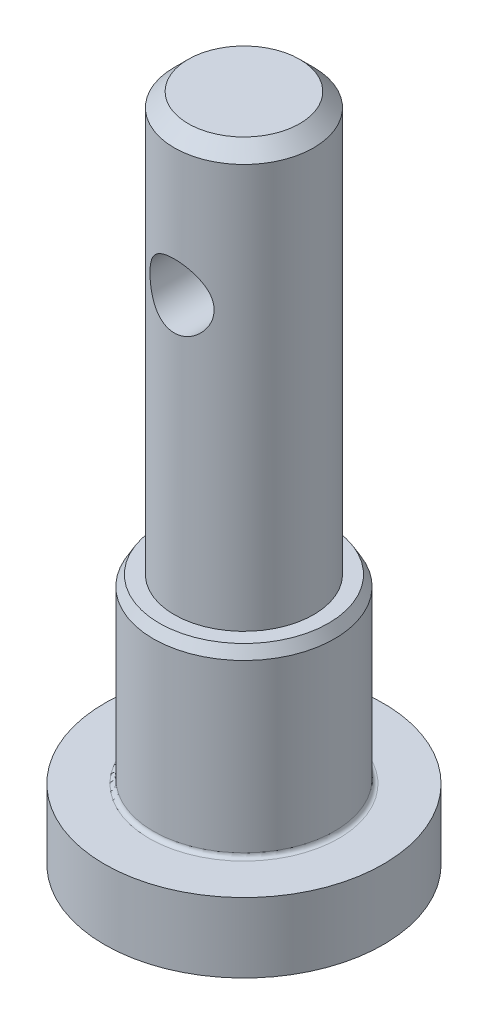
ISO-10303-21;
HEADER;
FILE_DESCRIPTION(('STEP AP214'),'2;1');
FILE_NAME('part.step','',(''),(''),'','','');
FILE_SCHEMA(('AUTOMOTIVE_DESIGN { 1 0 10303 214 1 1 1 1 }'));
ENDSEC;
DATA;
#1=APPLICATION_CONTEXT('core data for automotive mechanical design processes');
#2=APPLICATION_PROTOCOL_DEFINITION('international standard','automotive_design',2000,#1);
#3=PRODUCT_CONTEXT('',#1,'mechanical');
#4=PRODUCT('Part','Part','',(#3));
#5=PRODUCT_RELATED_PRODUCT_CATEGORY('part','',(#4));
#6=PRODUCT_DEFINITION_FORMATION('','',#4);
#7=PRODUCT_DEFINITION_CONTEXT('part definition',#1,'design');
#8=PRODUCT_DEFINITION('design','',#6,#7);
#9=PRODUCT_DEFINITION_SHAPE('','',#8);
#10=(LENGTH_UNIT() NAMED_UNIT(*) SI_UNIT(.MILLI.,.METRE.));
#11=(NAMED_UNIT(*) PLANE_ANGLE_UNIT() SI_UNIT($,.RADIAN.));
#12=(NAMED_UNIT(*) SI_UNIT($,.STERADIAN.) SOLID_ANGLE_UNIT());
#13=UNCERTAINTY_MEASURE_WITH_UNIT(LENGTH_MEASURE(1.E-05),#10,'distance_accuracy_value','');
#14=(GEOMETRIC_REPRESENTATION_CONTEXT(3) GLOBAL_UNCERTAINTY_ASSIGNED_CONTEXT((#13)) GLOBAL_UNIT_ASSIGNED_CONTEXT((#10,
#11,#12)) REPRESENTATION_CONTEXT('',''));
#15=CARTESIAN_POINT('',(0.,0.,0.));
#16=DIRECTION('',(0.,0.,1.));
#17=DIRECTION('',(1.,0.,0.));
#18=AXIS2_PLACEMENT_3D('',#15,#16,#17);
#19=CARTESIAN_POINT('',(0.,49.5125,0.));
#20=DIRECTION('',(0.,1.,0.));
#21=DIRECTION('',(0.,0.,1.));
#22=AXIS2_PLACEMENT_3D('',#19,#20,#21);
#23=CYLINDRICAL_SURFACE('',#22,6.49999999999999);
#24=CARTESIAN_POINT('',(0.,0.300000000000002,0.));
#25=DIRECTION('',(0.,1.,0.));
#26=DIRECTION('',(0.,0.,1.));
#27=AXIS2_PLACEMENT_3D('',#24,#25,#26);
#28=CIRCLE('',#27,6.49999999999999);
#29=CARTESIAN_POINT('',(0.,0.300000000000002,6.49999999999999));
#30=VERTEX_POINT('',#29);
#31=EDGE_CURVE('E32',#30,#30,#28,.T.);
#32=ORIENTED_EDGE('',*,*,#31,.T.);
#33=EDGE_LOOP('',(#32));
#34=FACE_BOUND('',#33,.T.);
#35=CARTESIAN_POINT('',(0.,12.25,0.));
#36=DIRECTION('',(0.,1.,0.));
#37=DIRECTION('',(0.,0.,1.));
#38=AXIS2_PLACEMENT_3D('',#35,#36,#37);
#39=CIRCLE('',#38,6.49999999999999);
#40=CARTESIAN_POINT('',(0.,12.25,6.49999999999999));
#41=VERTEX_POINT('',#40);
#42=EDGE_CURVE('E45',#41,#41,#39,.F.);
#43=ORIENTED_EDGE('',*,*,#42,.T.);
#44=EDGE_LOOP('',(#43));
#45=FACE_BOUND('',#44,.T.);
#46=ADVANCED_FACE('F26',(#34,#45),#23,.T.);
#47=CARTESIAN_POINT('',(6.49999999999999,0.,0.));
#48=DIRECTION('',(0.,1.,0.));
#49=DIRECTION('',(0.,0.,1.));
#50=AXIS2_PLACEMENT_3D('',#47,#48,#49);
#51=PLANE('',#50);
#52=CARTESIAN_POINT('',(0.,0.,0.));
#53=DIRECTION('',(0.,1.,0.));
#54=DIRECTION('',(0.,0.,1.));
#55=AXIS2_PLACEMENT_3D('',#52,#53,#54);
#56=CIRCLE('',#55,6.79999999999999);
#57=CARTESIAN_POINT('',(0.,0.,6.79999999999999));
#58=VERTEX_POINT('',#57);
#59=EDGE_CURVE('E10',#58,#58,#56,.F.);
#60=ORIENTED_EDGE('',*,*,#59,.T.);
#61=EDGE_LOOP('',(#60));
#62=FACE_BOUND('',#61,.T.);
#63=CARTESIAN_POINT('',(0.,0.,0.));
#64=DIRECTION('',(0.,1.,0.));
#65=DIRECTION('',(0.,0.,1.));
#66=AXIS2_PLACEMENT_3D('',#63,#64,#65);
#67=CIRCLE('',#66,9.99999999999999);
#68=CARTESIAN_POINT('',(0.,0.,9.99999999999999));
#69=VERTEX_POINT('',#68);
#70=EDGE_CURVE('E51',#69,#69,#67,.T.);
#71=ORIENTED_EDGE('',*,*,#70,.T.);
#72=EDGE_LOOP('',(#71));
#73=FACE_BOUND('',#72,.T.);
#74=ADVANCED_FACE('F86',(#62,#73),#51,.T.);
#75=CARTESIAN_POINT('',(0.,49.5125,0.));
#76=DIRECTION('',(0.,1.,0.));
#77=DIRECTION('',(0.,0.,1.));
#78=AXIS2_PLACEMENT_3D('',#75,#76,#77);
#79=CYLINDRICAL_SURFACE('',#78,9.99999999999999);
#80=CARTESIAN_POINT('',(0.,-5.,0.));
#81=DIRECTION('',(0.,1.,0.));
#82=DIRECTION('',(0.,0.,1.));
#83=AXIS2_PLACEMENT_3D('',#80,#81,#82);
#84=CIRCLE('',#83,9.99999999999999);
#85=CARTESIAN_POINT('',(0.,-5.,9.99999999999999));
#86=VERTEX_POINT('',#85);
#87=EDGE_CURVE('E127',#86,#86,#84,.T.);
#88=ORIENTED_EDGE('',*,*,#87,.T.);
#89=EDGE_LOOP('',(#88));
#90=FACE_BOUND('',#89,.T.);
#91=ORIENTED_EDGE('',*,*,#70,.F.);
#92=EDGE_LOOP('',(#91));
#93=FACE_BOUND('',#92,.T.);
#94=ADVANCED_FACE('F90',(#90,#93),#79,.T.);
#95=CARTESIAN_POINT('',(9.99999999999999,-5.,0.));
#96=DIRECTION('',(0.,-1.,0.));
#97=DIRECTION('',(0.,0.,-1.));
#98=AXIS2_PLACEMENT_3D('',#95,#96,#97);
#99=PLANE('',#98);
#100=ORIENTED_EDGE('',*,*,#87,.F.);
#101=EDGE_LOOP('',(#100));
#102=FACE_BOUND('',#101,.T.);
#103=ADVANCED_FACE('F113',(#102),#99,.T.);
#104=CARTESIAN_POINT('',(5.,43.,0.));
#105=DIRECTION('',(0.,-1.,0.));
#106=DIRECTION('',(0.,0.,-1.));
#107=AXIS2_PLACEMENT_3D('',#104,#105,#106);
#108=PLANE('',#107);
#109=CARTESIAN_POINT('',(0.,43.,0.));
#110=DIRECTION('',(0.,-1.,0.));
#111=DIRECTION('',(0.,0.,-1.));
#112=AXIS2_PLACEMENT_3D('',#109,#110,#111);
#113=CIRCLE('',#112,3.99999999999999);
#114=CARTESIAN_POINT('',(0.,43.,-3.99999999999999));
#115=VERTEX_POINT('',#114);
#116=EDGE_CURVE('E40',#115,#115,#113,.F.);
#117=ORIENTED_EDGE('',*,*,#116,.T.);
#118=EDGE_LOOP('',(#117));
#119=FACE_BOUND('',#118,.T.);
#120=ADVANCED_FACE('F82',(#119),#108,.F.);
#121=CARTESIAN_POINT('',(0.,49.5125,0.));
#122=DIRECTION('',(0.,1.,0.));
#123=DIRECTION('',(0.,0.,1.));
#124=AXIS2_PLACEMENT_3D('',#121,#122,#123);
#125=CYLINDRICAL_SURFACE('',#124,5.);
#126=CARTESIAN_POINT('',(0.,42.,0.));
#127=DIRECTION('',(0.,-1.,0.));
#128=DIRECTION('',(0.,0.,-1.));
#129=AXIS2_PLACEMENT_3D('',#126,#127,#128);
#130=CIRCLE('',#129,5.);
#131=CARTESIAN_POINT('',(0.,42.,-5.));
#132=VERTEX_POINT('',#131);
#133=EDGE_CURVE('E36',#132,#132,#130,.T.);
#134=ORIENTED_EDGE('',*,*,#133,.T.);
#135=EDGE_LOOP('',(#134));
#136=FACE_BOUND('',#135,.T.);
#137=CARTESIAN_POINT('',(0.,30.5,5.));
#138=CARTESIAN_POINT('',(-0.122041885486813,30.500007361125,4.99999394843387));
#139=CARTESIAN_POINT('',(-0.244266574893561,30.509771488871,4.9954819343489));
#140=CARTESIAN_POINT('',(-0.485172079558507,30.5484315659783,4.97787855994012));
#141=CARTESIAN_POINT('',(-0.60384419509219,30.5773710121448,4.96476769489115));
#142=CARTESIAN_POINT('',(-0.833783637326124,30.6530493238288,4.93135409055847));
#143=CARTESIAN_POINT('',(-0.945076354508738,30.6997229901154,4.91107771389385));
#144=CARTESIAN_POINT('',(-1.15811916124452,30.8092418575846,4.86524923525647));
#145=CARTESIAN_POINT('',(-1.25987101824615,30.872084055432,4.8396981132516));
#146=CARTESIAN_POINT('',(-1.45708046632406,31.016014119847,4.78413705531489));
#147=CARTESIAN_POINT('',(-1.55190939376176,31.0978987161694,4.75396163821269));
#148=CARTESIAN_POINT('',(-1.72705007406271,31.2758922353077,4.69317680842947));
#149=CARTESIAN_POINT('',(-1.80735254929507,31.3720101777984,4.66256713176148));
#150=CARTESIAN_POINT('',(-1.95619272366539,31.5830346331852,4.60219146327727));
#151=CARTESIAN_POINT('',(-2.02367242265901,31.6987427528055,4.57259970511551));
#152=CARTESIAN_POINT('',(-2.13793458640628,31.9414033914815,4.52031110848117));
#153=CARTESIAN_POINT('',(-2.18472992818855,32.0683488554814,4.49760998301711));
#154=CARTESIAN_POINT('',(-2.25356357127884,32.3226817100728,4.46350341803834));
#155=CARTESIAN_POINT('',(-2.27682015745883,32.4496621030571,4.45154619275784));
#156=CARTESIAN_POINT('',(-2.30169250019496,32.7062411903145,4.43874186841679));
#157=CARTESIAN_POINT('',(-2.30332435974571,32.8358378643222,4.43788650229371));
#158=CARTESIAN_POINT('',(-2.28580488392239,33.0804608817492,4.44692638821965));
#159=CARTESIAN_POINT('',(-2.26866065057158,33.1956778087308,4.4557835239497));
#160=CARTESIAN_POINT('',(-2.21749774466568,33.4213683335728,4.48146341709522));
#161=CARTESIAN_POINT('',(-2.18347490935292,33.531840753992,4.49828813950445));
#162=CARTESIAN_POINT('',(-2.09885026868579,33.7479504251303,4.53839772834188));
#163=CARTESIAN_POINT('',(-2.04788648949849,33.8534189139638,4.56182176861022));
#164=CARTESIAN_POINT('',(-1.93109049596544,34.0547713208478,4.61247614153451));
#165=CARTESIAN_POINT('',(-1.86525184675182,34.1506510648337,4.63970811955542));
#166=CARTESIAN_POINT('',(-1.71247557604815,34.3407178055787,4.69838219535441));
#167=CARTESIAN_POINT('',(-1.6240473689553,34.4336667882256,4.7299659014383));
#168=CARTESIAN_POINT('',(-1.43262626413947,34.6038826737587,4.79141773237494));
#169=CARTESIAN_POINT('',(-1.32962834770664,34.6811441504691,4.82128526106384));
#170=CARTESIAN_POINT('',(-1.10752206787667,34.8201781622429,4.87718425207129));
#171=CARTESIAN_POINT('',(-0.987987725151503,34.8813409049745,4.90305249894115));
#172=CARTESIAN_POINT('',(-0.738830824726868,34.9822371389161,4.94672403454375));
#173=CARTESIAN_POINT('',(-0.609215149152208,35.0219851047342,4.96453276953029));
#174=CARTESIAN_POINT('',(-0.353823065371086,35.0760874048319,4.98899184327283));
#175=CARTESIAN_POINT('',(-0.228466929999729,35.0920963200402,4.99636737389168));
#176=CARTESIAN_POINT('',(0.0233512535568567,35.1033283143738,5.00152878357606));
#177=CARTESIAN_POINT('',(0.149812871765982,35.0985591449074,4.99931823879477));
#178=CARTESIAN_POINT('',(0.391793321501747,35.0694517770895,4.98600706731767));
#179=CARTESIAN_POINT('',(0.507498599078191,35.0463694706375,4.97547715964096));
#180=CARTESIAN_POINT('',(0.733214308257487,34.9831487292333,4.94725590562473));
#181=CARTESIAN_POINT('',(0.843224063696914,34.9430082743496,4.92956371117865));
#182=CARTESIAN_POINT('',(1.05830091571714,34.8455733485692,4.88798254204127));
#183=CARTESIAN_POINT('',(1.16311052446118,34.7877874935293,4.86391910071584));
#184=CARTESIAN_POINT('',(1.36191969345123,34.6572381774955,4.81204195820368));
#185=CARTESIAN_POINT('',(1.4559144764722,34.5844681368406,4.78422661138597));
#186=CARTESIAN_POINT('',(1.63892933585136,34.4187721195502,4.72482193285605));
#187=CARTESIAN_POINT('',(1.72683348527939,34.3246535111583,4.6931134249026));
#188=CARTESIAN_POINT('',(1.88601098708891,34.1226882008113,4.63144312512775));
#189=CARTESIAN_POINT('',(1.95727704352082,34.0148355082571,4.60148210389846));
#190=CARTESIAN_POINT('',(2.08302279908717,33.784253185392,4.54597558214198));
#191=CARTESIAN_POINT('',(2.13694319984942,33.6611777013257,4.52058702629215));
#192=CARTESIAN_POINT('',(2.22275575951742,33.4061413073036,4.47902545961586));
#193=CARTESIAN_POINT('',(2.25467144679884,33.2741900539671,4.46284260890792));
#194=CARTESIAN_POINT('',(2.29300876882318,33.0177261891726,4.44325691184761));
#195=CARTESIAN_POINT('',(2.30143920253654,32.8935907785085,4.43884851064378));
#196=CARTESIAN_POINT('',(2.29815984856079,32.6456755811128,4.44054834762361));
#197=CARTESIAN_POINT('',(2.28645526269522,32.5218957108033,4.44665386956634));
#198=CARTESIAN_POINT('',(2.24503325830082,32.2871043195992,4.4676951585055));
#199=CARTESIAN_POINT('',(2.21661248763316,32.1758006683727,4.48199353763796));
#200=CARTESIAN_POINT('',(2.14399474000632,31.9595817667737,4.51717890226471));
#201=CARTESIAN_POINT('',(2.099793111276,31.8546684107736,4.5380678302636));
#202=CARTESIAN_POINT('',(1.99356103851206,31.6466397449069,4.5857725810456));
#203=CARTESIAN_POINT('',(1.93055001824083,31.5440954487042,4.61288763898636));
#204=CARTESIAN_POINT('',(1.78970957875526,31.350415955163,4.66933561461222));
#205=CARTESIAN_POINT('',(1.71187344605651,31.2592859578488,4.69866953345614));
#206=CARTESIAN_POINT('',(1.53473287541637,31.0819293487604,4.75963991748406));
#207=CARTESIAN_POINT('',(1.43408232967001,30.9970219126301,4.79122580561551));
#208=CARTESIAN_POINT('',(1.21893934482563,30.8451228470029,4.85042737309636));
#209=CARTESIAN_POINT('',(1.10444046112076,30.778139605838,4.87804119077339));
#210=CARTESIAN_POINT('',(0.865135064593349,30.6648453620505,4.9260790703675));
#211=CARTESIAN_POINT('',(0.740410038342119,30.6183867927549,4.94655422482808));
#212=CARTESIAN_POINT('',(0.548210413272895,30.5652971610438,4.9702780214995));
#213=CARTESIAN_POINT('',(0.48334502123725,30.5503722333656,4.97701856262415));
#214=CARTESIAN_POINT('',(0.352373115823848,30.526180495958,4.98799900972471));
#215=CARTESIAN_POINT('',(0.286267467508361,30.5169098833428,4.99224059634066));
#216=CARTESIAN_POINT('',(0.183335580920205,30.5070248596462,4.99677160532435));
#217=CARTESIAN_POINT('',(0.146730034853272,30.5043923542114,4.99798062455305));
#218=CARTESIAN_POINT('',(0.0734218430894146,30.5008788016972,4.9995957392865));
#219=CARTESIAN_POINT('',(0.0367191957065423,30.4999977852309,5.00000182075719));
#220=CARTESIAN_POINT('',(0.,30.5,5.));
#221=B_SPLINE_CURVE_WITH_KNOTS('',3,(#137,#138,#139,#140,#141,#142,#143,#144,#145,#146,#147,
#148,#149,#150,#151,#152,#153,#154,#155,#156,#157,#158,#159,#160,#161,#162,#163,#164,#165,#166,
#167,#168,#169,#170,#171,#172,#173,#174,#175,#176,#177,#178,#179,#180,#181,#182,#183,#184,#185,
#186,#187,#188,#189,#190,#191,#192,#193,#194,#195,#196,#197,#198,#199,#200,#201,#202,#203,#204,
#205,#206,#207,#208,#209,#210,#211,#212,#213,#214,#215,#216,#217,#218,#219,#220),.UNSPECIFIED.,
.T.,.F.,(4,2,2,2,2,2,2,2,2,2,2,2,2,2,2,2,2,2,2,2,2,2,2,2,2,2,2,2,2,2,2,2,2,2,2,2,2,2,2,2,2,4),
(0.,0.365982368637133,0.732797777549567,1.09827745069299,1.46368928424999,1.84866513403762,
2.23388599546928,2.64334229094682,3.05254331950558,3.43927577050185,3.82572022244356,
4.17455708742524,4.52348002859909,4.88039695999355,5.23746859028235,5.63208508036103,
6.02683783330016,6.43489508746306,6.84267618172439,7.22042533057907,7.59803356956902,
7.95177546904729,8.30555926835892,8.67026658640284,9.03513439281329,9.4312584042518,
9.82755579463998,10.2355832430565,10.6431737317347,11.0146401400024,11.3860105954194,
11.731793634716,12.0776786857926,12.4462889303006,12.8150664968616,13.2193880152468,
13.6238984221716,14.0254512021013,14.2259116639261,14.426237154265,14.5363497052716,
14.6464641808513),.UNSPECIFIED.);
#222=CARTESIAN_POINT('',(0.,30.5,5.));
#223=VERTEX_POINT('',#222);
#224=EDGE_CURVE('E52',#223,#223,#221,.T.);
#225=ORIENTED_EDGE('',*,*,#224,.T.);
#226=EDGE_LOOP('',(#225));
#227=FACE_BOUND('',#226,.T.);
#228=CARTESIAN_POINT('',(2.3,32.8,-4.43959457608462));
#229=CARTESIAN_POINT('',(2.29999229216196,32.9212694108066,-4.43960320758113));
#230=CARTESIAN_POINT('',(2.29034635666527,33.0427278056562,-4.44463694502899));
#231=CARTESIAN_POINT('',(2.25220031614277,33.2820273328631,-4.46408179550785));
#232=CARTESIAN_POINT('',(2.22365453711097,33.3998589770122,-4.47851562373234));
#233=CARTESIAN_POINT('',(2.14912420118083,33.6280088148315,-4.51474887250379));
#234=CARTESIAN_POINT('',(2.10322135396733,33.7383593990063,-4.53651373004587));
#235=CARTESIAN_POINT('',(1.99552627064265,33.9497660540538,-4.58490435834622));
#236=CARTESIAN_POINT('',(1.93373541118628,34.0508229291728,-4.61152970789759));
#237=CARTESIAN_POINT('',(1.79098738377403,34.2485300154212,-4.66890482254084));
#238=CARTESIAN_POINT('',(1.70899924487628,34.3443903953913,-4.69981252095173));
#239=CARTESIAN_POINT('',(1.53033862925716,34.5215995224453,-4.76098502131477));
#240=CARTESIAN_POINT('',(1.43365975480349,34.602941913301,-4.7912495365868));
#241=CARTESIAN_POINT('',(1.2218570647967,34.7531567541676,-4.84971840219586));
#242=CARTESIAN_POINT('',(1.10601183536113,34.8210989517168,-4.87771830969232));
#243=CARTESIAN_POINT('',(0.863009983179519,34.9361781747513,-4.92651307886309));
#244=CARTESIAN_POINT('',(0.735859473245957,34.9833263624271,-4.94731180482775));
#245=CARTESIAN_POINT('',(0.482188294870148,35.0524858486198,-4.97823230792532));
#246=CARTESIAN_POINT('',(0.356114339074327,35.0758705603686,-4.98893449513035));
#247=CARTESIAN_POINT('',(0.101410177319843,35.1013197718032,-5.00059358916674));
#248=CARTESIAN_POINT('',(-0.0272187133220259,35.1033949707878,-5.00155538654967));
#249=CARTESIAN_POINT('',(-0.273228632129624,35.0867921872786,-4.99393438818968));
#250=CARTESIAN_POINT('',(-0.390738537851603,35.069636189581,-4.98605152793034));
#251=CARTESIAN_POINT('',(-0.620992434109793,35.0177238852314,-4.96263685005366));
#252=CARTESIAN_POINT('',(-0.733736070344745,34.9829662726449,-4.9471044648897));
#253=CARTESIAN_POINT('',(-0.953336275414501,34.8964951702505,-4.90955775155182));
#254=CARTESIAN_POINT('',(-1.06007875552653,34.8445344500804,-4.88744941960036));
#255=CARTESIAN_POINT('',(-1.26360680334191,34.7254133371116,-4.83882866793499));
#256=CARTESIAN_POINT('',(-1.36038870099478,34.6582473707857,-4.81231463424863));
#257=CARTESIAN_POINT('',(-1.54981490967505,34.5041689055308,-4.75485722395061));
#258=CARTESIAN_POINT('',(-1.64144667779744,34.4160791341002,-4.72372886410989));
#259=CARTESIAN_POINT('',(-1.80913244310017,34.2258780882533,-4.66208509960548));
#260=CARTESIAN_POINT('',(-1.88517759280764,34.1237589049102,-4.63157005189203));
#261=CARTESIAN_POINT('',(-2.02298376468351,33.9024129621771,-4.57311830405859));
#262=CARTESIAN_POINT('',(-2.0839010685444,33.7826061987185,-4.54537130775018));
#263=CARTESIAN_POINT('',(-2.18426733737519,33.532835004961,-4.4980096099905));
#264=CARTESIAN_POINT('',(-2.22373544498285,33.402879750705,-4.47838766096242));
#265=CARTESIAN_POINT('',(-2.2772070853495,33.1466552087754,-4.45142308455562));
#266=CARTESIAN_POINT('',(-2.29287121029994,33.0208187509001,-4.44328289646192));
#267=CARTESIAN_POINT('',(-2.3032486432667,32.7680788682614,-4.43791534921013));
#268=CARTESIAN_POINT('',(-2.29797231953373,32.6411760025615,-4.44068258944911));
#269=CARTESIAN_POINT('',(-2.26814047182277,32.4013961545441,-4.45598092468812));
#270=CARTESIAN_POINT('',(-2.24527044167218,32.2882471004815,-4.46765771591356));
#271=CARTESIAN_POINT('',(-2.18326656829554,32.0675423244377,-4.49828116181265));
#272=CARTESIAN_POINT('',(-2.14412831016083,31.9599881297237,-4.51722978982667));
#273=CARTESIAN_POINT('',(-2.04875813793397,31.7479942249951,-4.5613002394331));
#274=CARTESIAN_POINT('',(-1.99182701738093,31.6439212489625,-4.58666452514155));
#275=CARTESIAN_POINT('',(-1.86313512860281,31.4462447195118,-4.64042964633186));
#276=CARTESIAN_POINT('',(-1.79136712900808,31.3526463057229,-4.6688319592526));
#277=CARTESIAN_POINT('',(-1.62634842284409,31.1684957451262,-4.72900246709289));
#278=CARTESIAN_POINT('',(-1.53164523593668,31.0792541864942,-4.76081560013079));
#279=CARTESIAN_POINT('',(-1.32796666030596,30.9176055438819,-4.82159640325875));
#280=CARTESIAN_POINT('',(-1.21898859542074,30.8452016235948,-4.85056353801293));
#281=CARTESIAN_POINT('',(-0.987718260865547,30.7186557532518,-4.90292027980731));
#282=CARTESIAN_POINT('',(-0.86527448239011,30.6647573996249,-4.92623438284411));
#283=CARTESIAN_POINT('',(-0.611686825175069,30.578800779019,-4.96409348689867));
#284=CARTESIAN_POINT('',(-0.480549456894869,30.5467263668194,-4.97864496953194));
#285=CARTESIAN_POINT('',(-0.224871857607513,30.507671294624,-4.99644887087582));
#286=CARTESIAN_POINT('',(-0.1006684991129,30.4988538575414,-5.00052761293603));
#287=CARTESIAN_POINT('',(0.147472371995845,30.5013842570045,-4.99936285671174));
#288=CARTESIAN_POINT('',(0.27140994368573,30.5127270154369,-4.99412170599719));
#289=CARTESIAN_POINT('',(0.509049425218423,30.5539607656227,-4.97537766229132));
#290=CARTESIAN_POINT('',(0.622953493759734,30.5828980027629,-4.96230006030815));
#291=CARTESIAN_POINT('',(0.8441771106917,30.657339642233,-4.92949086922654));
#292=CARTESIAN_POINT('',(0.951495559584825,30.7028468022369,-4.90975817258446));
#293=CARTESIAN_POINT('',(1.16193811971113,30.8113942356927,-4.86436182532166));
#294=CARTESIAN_POINT('',(1.26464785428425,30.8751393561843,-4.83846876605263));
#295=CARTESIAN_POINT('',(1.45836392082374,31.0174077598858,-4.78365194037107));
#296=CARTESIAN_POINT('',(1.54936503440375,31.0959375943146,-4.75472683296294));
#297=CARTESIAN_POINT('',(1.72516335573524,31.2733402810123,-4.6939514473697));
#298=CARTESIAN_POINT('',(1.80878069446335,31.3733733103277,-4.66206106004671));
#299=CARTESIAN_POINT('',(1.95834568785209,31.5867860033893,-4.60124066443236));
#300=CARTESIAN_POINT('',(2.02428132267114,31.700174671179,-4.57231267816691));
#301=CARTESIAN_POINT('',(2.13693908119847,31.9391506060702,-4.52077513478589));
#302=CARTESIAN_POINT('',(2.18345530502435,32.0648519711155,-4.49823406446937));
#303=CARTESIAN_POINT('',(2.23639579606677,32.2586767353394,-4.47201340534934));
#304=CARTESIAN_POINT('',(2.2512310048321,32.3241006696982,-4.46454176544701));
#305=CARTESIAN_POINT('',(2.27515220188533,32.4562316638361,-4.45240025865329));
#306=CARTESIAN_POINT('',(2.28424242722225,32.5229377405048,-4.44772832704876));
#307=CARTESIAN_POINT('',(2.29358919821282,32.6248498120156,-4.44291121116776));
#308=CARTESIAN_POINT('',(2.29599146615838,32.659823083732,-4.44166962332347));
#309=CARTESIAN_POINT('',(2.29919801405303,32.7298589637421,-4.44001004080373));
#310=CARTESIAN_POINT('',(2.30000222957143,32.7649215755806,-4.43959207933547));
#311=CARTESIAN_POINT('',(2.3,32.8,-4.43959457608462));
#312=B_SPLINE_CURVE_WITH_KNOTS('',3,(#228,#229,#230,#231,#232,#233,#234,#235,#236,#237,#238,
#239,#240,#241,#242,#243,#244,#245,#246,#247,#248,#249,#250,#251,#252,#253,#254,#255,#256,#257,
#258,#259,#260,#261,#262,#263,#264,#265,#266,#267,#268,#269,#270,#271,#272,#273,#274,#275,#276,
#277,#278,#279,#280,#281,#282,#283,#284,#285,#286,#287,#288,#289,#290,#291,#292,#293,#294,#295,
#296,#297,#298,#299,#300,#301,#302,#303,#304,#305,#306,#307,#308,#309,#310,#311),.UNSPECIFIED.,
.T.,.F.,(4,2,2,2,2,2,2,2,2,2,2,2,2,2,2,2,2,2,2,2,2,2,2,2,2,2,2,2,2,2,2,2,2,2,2,2,2,2,2,2,2,4),
(0.,0.363667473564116,0.728217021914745,1.09107137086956,1.45389429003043,1.84184358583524,
2.22996231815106,2.63939758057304,3.04861279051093,3.43253799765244,3.81627043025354,
4.1716514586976,4.52705885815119,4.8878132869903,5.24870016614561,5.63958337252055,
6.03068784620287,6.4402541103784,6.84945424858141,7.22853316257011,7.60742440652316,
7.95394765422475,8.30056500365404,8.66301677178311,9.02564561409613,9.42568750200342,
9.82580449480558,10.2310028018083,10.6359010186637,11.0077045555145,11.3794144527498,
11.7325768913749,12.0857981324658,12.4551252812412,12.8246164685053,13.2254300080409,
13.6265153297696,14.0317514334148,14.2339947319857,14.4360886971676,14.5412790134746,
14.6464735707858),.UNSPECIFIED.);
#313=CARTESIAN_POINT('',(2.3,32.8,-4.43959457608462));
#314=VERTEX_POINT('',#313);
#315=EDGE_CURVE('E60',#314,#314,#312,.T.);
#316=ORIENTED_EDGE('',*,*,#315,.T.);
#317=EDGE_LOOP('',(#316));
#318=FACE_BOUND('',#317,.T.);
#319=CARTESIAN_POINT('',(0.,13.,0.));
#320=DIRECTION('',(0.,1.,0.));
#321=DIRECTION('',(0.,0.,1.));
#322=AXIS2_PLACEMENT_3D('',#319,#320,#321);
#323=CIRCLE('',#322,5.);
#324=CARTESIAN_POINT('',(0.,13.,5.));
#325=VERTEX_POINT('',#324);
#326=EDGE_CURVE('E59',#325,#325,#323,.T.);
#327=ORIENTED_EDGE('',*,*,#326,.T.);
#328=EDGE_LOOP('',(#327));
#329=FACE_BOUND('',#328,.T.);
#330=ADVANCED_FACE('F64',(#136,#227,#318,#329),#125,.T.);
#331=CARTESIAN_POINT('',(5.,13.,0.));
#332=DIRECTION('',(0.,1.,0.));
#333=DIRECTION('',(0.,0.,1.));
#334=AXIS2_PLACEMENT_3D('',#331,#332,#333);
#335=PLANE('',#334);
#336=CARTESIAN_POINT('',(0.,13.,0.));
#337=DIRECTION('',(0.,1.,0.));
#338=DIRECTION('',(0.,0.,1.));
#339=AXIS2_PLACEMENT_3D('',#336,#337,#338);
#340=CIRCLE('',#339,6.06698729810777);
#341=CARTESIAN_POINT('',(0.,13.,6.06698729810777));
#342=VERTEX_POINT('',#341);
#343=EDGE_CURVE('E48',#342,#342,#340,.T.);
#344=ORIENTED_EDGE('',*,*,#343,.T.);
#345=EDGE_LOOP('',(#344));
#346=FACE_BOUND('',#345,.T.);
#347=ORIENTED_EDGE('',*,*,#326,.F.);
#348=EDGE_LOOP('',(#347));
#349=FACE_BOUND('',#348,.T.);
#350=ADVANCED_FACE('F73',(#346,#349),#335,.T.);
#351=CARTESIAN_POINT('',(0.,32.8,-9.99999999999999));
#352=DIRECTION('',(0.,0.,1.));
#353=DIRECTION('',(1.,0.,0.));
#354=AXIS2_PLACEMENT_3D('',#351,#352,#353);
#355=CYLINDRICAL_SURFACE('',#354,2.3);
#356=ORIENTED_EDGE('',*,*,#315,.F.);
#357=EDGE_LOOP('',(#356));
#358=FACE_BOUND('',#357,.T.);
#359=ORIENTED_EDGE('',*,*,#224,.F.);
#360=EDGE_LOOP('',(#359));
#361=FACE_BOUND('',#360,.T.);
#362=ADVANCED_FACE('F68',(#358,#361),#355,.F.);
#363=CARTESIAN_POINT('',(0.,13.,0.));
#364=DIRECTION('',(0.,-1.,0.));
#365=DIRECTION('',(0.,0.,-1.));
#366=AXIS2_PLACEMENT_3D('',#363,#364,#365);
#367=CONICAL_SURFACE('',#366,6.06698729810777,0.523598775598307);
#368=ORIENTED_EDGE('',*,*,#42,.F.);
#369=EDGE_LOOP('',(#368));
#370=FACE_BOUND('',#369,.T.);
#371=ORIENTED_EDGE('',*,*,#343,.F.);
#372=EDGE_LOOP('',(#371));
#373=FACE_BOUND('',#372,.T.);
#374=ADVANCED_FACE('F72',(#370,#373),#367,.T.);
#375=CARTESIAN_POINT('',(0.,43.,0.));
#376=DIRECTION('',(0.,-1.,0.));
#377=DIRECTION('',(0.,0.,-1.));
#378=AXIS2_PLACEMENT_3D('',#375,#376,#377);
#379=CONICAL_SURFACE('',#378,3.99999999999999,0.785398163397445);
#380=ORIENTED_EDGE('',*,*,#133,.F.);
#381=EDGE_LOOP('',(#380));
#382=FACE_BOUND('',#381,.T.);
#383=ORIENTED_EDGE('',*,*,#116,.F.);
#384=EDGE_LOOP('',(#383));
#385=FACE_BOUND('',#384,.T.);
#386=ADVANCED_FACE('F96',(#382,#385),#379,.T.);
#387=CARTESIAN_POINT('',(0.,0.300000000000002,0.));
#388=DIRECTION('',(0.,1.,0.));
#389=DIRECTION('',(0.,0.,1.));
#390=AXIS2_PLACEMENT_3D('',#387,#388,#389);
#391=TOROIDAL_SURFACE('',#390,6.79999999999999,0.3);
#392=ORIENTED_EDGE('',*,*,#59,.F.);
#393=EDGE_LOOP('',(#392));
#394=FACE_BOUND('',#393,.T.);
#395=ORIENTED_EDGE('',*,*,#31,.F.);
#396=EDGE_LOOP('',(#395));
#397=FACE_BOUND('',#396,.T.);
#398=ADVANCED_FACE('F101',(#394,#397),#391,.F.);
#399=CLOSED_SHELL('',(#46,#74,#94,#103,#120,#330,#350,#362,#374,#386,#398));
#400=MANIFOLD_SOLID_BREP('B2',#399);
#401=ADVANCED_BREP_SHAPE_REPRESENTATION('',(#18,#400),#14);
#402=SHAPE_DEFINITION_REPRESENTATION(#9,#401);
ENDSEC;
END-ISO-10303-21;
